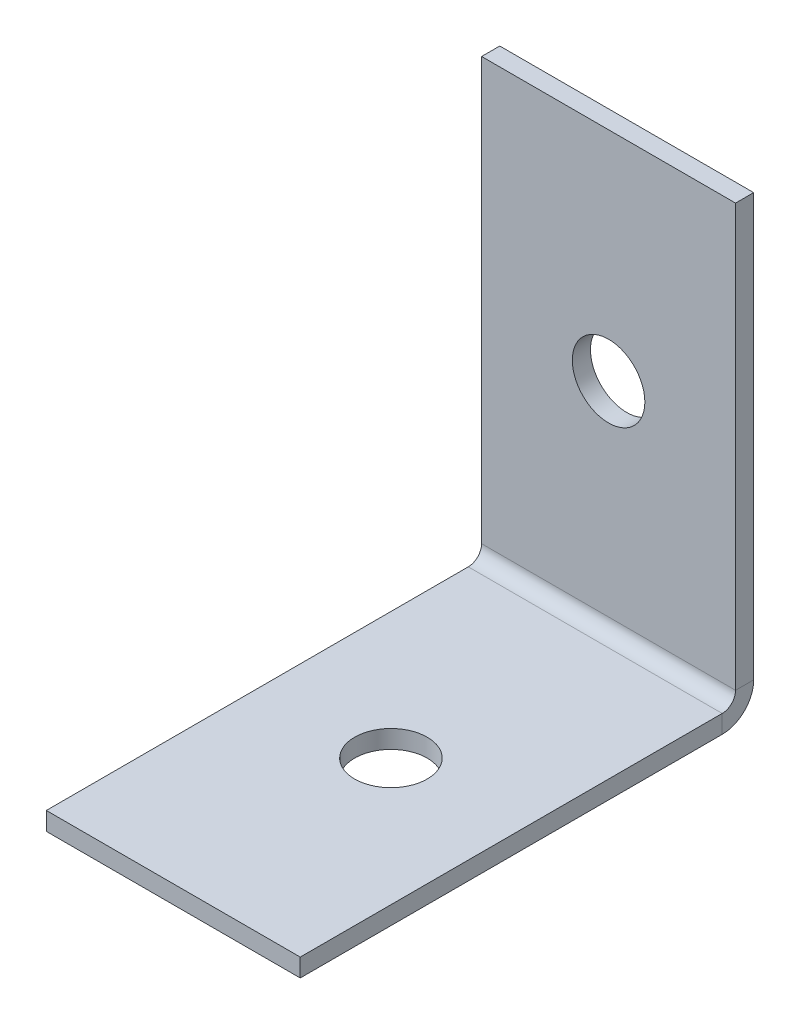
ISO-10303-21;
HEADER;
FILE_DESCRIPTION(('STEP AP214'),'2;1');
FILE_NAME('part.step','',(''),(''),'','','');
FILE_SCHEMA(('AUTOMOTIVE_DESIGN { 1 0 10303 214 1 1 1 1 }'));
ENDSEC;
DATA;
#1=APPLICATION_CONTEXT('core data for automotive mechanical design processes');
#2=APPLICATION_PROTOCOL_DEFINITION('international standard','automotive_design',2000,#1);
#3=PRODUCT_CONTEXT('',#1,'mechanical');
#4=PRODUCT('Part','Part','',(#3));
#5=PRODUCT_RELATED_PRODUCT_CATEGORY('part','',(#4));
#6=PRODUCT_DEFINITION_FORMATION('','',#4);
#7=PRODUCT_DEFINITION_CONTEXT('part definition',#1,'design');
#8=PRODUCT_DEFINITION('design','',#6,#7);
#9=PRODUCT_DEFINITION_SHAPE('','',#8);
#10=(LENGTH_UNIT() NAMED_UNIT(*) SI_UNIT(.MILLI.,.METRE.));
#11=(NAMED_UNIT(*) PLANE_ANGLE_UNIT() SI_UNIT($,.RADIAN.));
#12=(NAMED_UNIT(*) SI_UNIT($,.STERADIAN.) SOLID_ANGLE_UNIT());
#13=UNCERTAINTY_MEASURE_WITH_UNIT(LENGTH_MEASURE(1.E-05),#10,'distance_accuracy_value','');
#14=(GEOMETRIC_REPRESENTATION_CONTEXT(3) GLOBAL_UNCERTAINTY_ASSIGNED_CONTEXT((#13)) GLOBAL_UNIT_ASSIGNED_CONTEXT((#10,
#11,#12)) REPRESENTATION_CONTEXT('',''));
#15=CARTESIAN_POINT('',(0.,0.,0.));
#16=DIRECTION('',(0.,0.,1.));
#17=DIRECTION('',(1.,0.,0.));
#18=AXIS2_PLACEMENT_3D('',#15,#16,#17);
#19=CARTESIAN_POINT('',(7.,0.,1.7366));
#20=DIRECTION('',(1.,0.,0.));
#21=DIRECTION('',(0.,0.,-1.));
#22=AXIS2_PLACEMENT_3D('',#19,#20,#21);
#23=PLANE('',#22);
#24=DIRECTION('',(0.,1.,0.));
#25=VECTOR('',#24,1.);
#26=CARTESIAN_POINT('',(7.,0.,1.7366));
#27=LINE('',#26,#25);
#28=CARTESIAN_POINT('',(7.,0.,1.7366));
#29=VERTEX_POINT('',#28);
#30=CARTESIAN_POINT('',(7.,1.,1.7366));
#31=VERTEX_POINT('',#30);
#32=EDGE_CURVE('E11',#29,#31,#27,.T.);
#33=ORIENTED_EDGE('',*,*,#32,.F.);
#34=CARTESIAN_POINT('',(7.,1.7366,1.7366));
#35=DIRECTION('',(1.,0.,0.));
#36=DIRECTION('',(0.,0.,-1.));
#37=AXIS2_PLACEMENT_3D('',#34,#35,#36);
#38=CIRCLE('',#37,1.7366);
#39=CARTESIAN_POINT('',(7.,1.7366,0.));
#40=VERTEX_POINT('',#39);
#41=EDGE_CURVE('E131',#40,#29,#38,.F.);
#42=ORIENTED_EDGE('',*,*,#41,.F.);
#43=DIRECTION('',(0.,0.,-1.));
#44=VECTOR('',#43,1.);
#45=CARTESIAN_POINT('',(7.,1.7366,1.));
#46=LINE('',#45,#44);
#47=CARTESIAN_POINT('',(7.,1.7366,1.));
#48=VERTEX_POINT('',#47);
#49=EDGE_CURVE('E42',#48,#40,#46,.T.);
#50=ORIENTED_EDGE('',*,*,#49,.F.);
#51=CARTESIAN_POINT('',(7.,1.7366,1.7366));
#52=DIRECTION('',(1.,0.,0.));
#53=DIRECTION('',(0.,0.,-1.));
#54=AXIS2_PLACEMENT_3D('',#51,#52,#53);
#55=CIRCLE('',#54,0.7366);
#56=EDGE_CURVE('E124',#48,#31,#55,.F.);
#57=ORIENTED_EDGE('',*,*,#56,.T.);
#58=EDGE_LOOP('',(#33,#42,#50,#57));
#59=FACE_BOUND('',#58,.T.);
#60=ADVANCED_FACE('F34',(#59),#23,.T.);
#61=CARTESIAN_POINT('',(7.,1.7366,1.));
#62=DIRECTION('',(1.,0.,0.));
#63=DIRECTION('',(0.,0.,-1.));
#64=AXIS2_PLACEMENT_3D('',#61,#62,#63);
#65=PLANE('',#64);
#66=DIRECTION('',(0.,0.,1.));
#67=VECTOR('',#66,1.);
#68=CARTESIAN_POINT('',(7.,0.,0.));
#69=LINE('',#68,#67);
#70=CARTESIAN_POINT('',(7.,0.,25.));
#71=VERTEX_POINT('',#70);
#72=EDGE_CURVE('E181',#29,#71,#69,.T.);
#73=ORIENTED_EDGE('',*,*,#72,.F.);
#74=ORIENTED_EDGE('',*,*,#32,.T.);
#75=DIRECTION('',(0.,0.,1.));
#76=VECTOR('',#75,1.);
#77=CARTESIAN_POINT('',(7.,1.,0.));
#78=LINE('',#77,#76);
#79=CARTESIAN_POINT('',(7.,0.999999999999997,25.));
#80=VERTEX_POINT('',#79);
#81=EDGE_CURVE('E90',#31,#80,#78,.T.);
#82=ORIENTED_EDGE('',*,*,#81,.T.);
#83=DIRECTION('',(0.,1.,0.));
#84=VECTOR('',#83,1.);
#85=CARTESIAN_POINT('',(7.,0.,25.));
#86=LINE('',#85,#84);
#87=EDGE_CURVE('E377',#71,#80,#86,.T.);
#88=ORIENTED_EDGE('',*,*,#87,.F.);
#89=EDGE_LOOP('',(#73,#74,#82,#88));
#90=FACE_BOUND('',#89,.T.);
#91=ADVANCED_FACE('F189',(#90),#65,.T.);
#92=CARTESIAN_POINT('',(-7.,1.7366,0.));
#93=DIRECTION('',(-1.,0.,0.));
#94=DIRECTION('',(0.,0.,1.));
#95=AXIS2_PLACEMENT_3D('',#92,#93,#94);
#96=PLANE('',#95);
#97=DIRECTION('',(0.,0.,1.));
#98=VECTOR('',#97,1.);
#99=CARTESIAN_POINT('',(-7.,1.7366,0.));
#100=LINE('',#99,#98);
#101=CARTESIAN_POINT('',(-7.,1.7366,0.));
#102=VERTEX_POINT('',#101);
#103=CARTESIAN_POINT('',(-7.,1.7366,1.));
#104=VERTEX_POINT('',#103);
#105=EDGE_CURVE('E77',#102,#104,#100,.T.);
#106=ORIENTED_EDGE('',*,*,#105,.F.);
#107=CARTESIAN_POINT('',(-7.,1.7366,1.7366));
#108=DIRECTION('',(1.,0.,0.));
#109=DIRECTION('',(0.,0.,-1.));
#110=AXIS2_PLACEMENT_3D('',#107,#108,#109);
#111=CIRCLE('',#110,1.7366);
#112=CARTESIAN_POINT('',(-7.,0.,1.7366));
#113=VERTEX_POINT('',#112);
#114=EDGE_CURVE('E147',#102,#113,#111,.F.);
#115=ORIENTED_EDGE('',*,*,#114,.T.);
#116=DIRECTION('',(0.,-1.,0.));
#117=VECTOR('',#116,1.);
#118=CARTESIAN_POINT('',(-7.,1.,1.7366));
#119=LINE('',#118,#117);
#120=CARTESIAN_POINT('',(-7.,1.,1.7366));
#121=VERTEX_POINT('',#120);
#122=EDGE_CURVE('E84',#121,#113,#119,.T.);
#123=ORIENTED_EDGE('',*,*,#122,.F.);
#124=CARTESIAN_POINT('',(-7.,1.7366,1.7366));
#125=DIRECTION('',(1.,0.,0.));
#126=DIRECTION('',(0.,0.,-1.));
#127=AXIS2_PLACEMENT_3D('',#124,#125,#126);
#128=CIRCLE('',#127,0.7366);
#129=EDGE_CURVE('E154',#104,#121,#128,.F.);
#130=ORIENTED_EDGE('',*,*,#129,.F.);
#131=EDGE_LOOP('',(#106,#115,#123,#130));
#132=FACE_BOUND('',#131,.T.);
#133=ADVANCED_FACE('F187',(#132),#96,.T.);
#134=CARTESIAN_POINT('',(-7.,1.,1.7366));
#135=DIRECTION('',(-1.,0.,0.));
#136=DIRECTION('',(0.,0.,1.));
#137=AXIS2_PLACEMENT_3D('',#134,#135,#136);
#138=PLANE('',#137);
#139=DIRECTION('',(0.,-1.,0.));
#140=VECTOR('',#139,1.);
#141=CARTESIAN_POINT('',(-7.,25.,0.));
#142=LINE('',#141,#140);
#143=CARTESIAN_POINT('',(-7.,25.,0.));
#144=VERTEX_POINT('',#143);
#145=EDGE_CURVE('E149',#144,#102,#142,.T.);
#146=ORIENTED_EDGE('',*,*,#145,.T.);
#147=ORIENTED_EDGE('',*,*,#105,.T.);
#148=DIRECTION('',(0.,-1.,0.));
#149=VECTOR('',#148,1.);
#150=CARTESIAN_POINT('',(-7.,25.,0.999999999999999));
#151=LINE('',#150,#149);
#152=CARTESIAN_POINT('',(-7.,25.,0.999999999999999));
#153=VERTEX_POINT('',#152);
#154=EDGE_CURVE('E152',#153,#104,#151,.T.);
#155=ORIENTED_EDGE('',*,*,#154,.F.);
#156=DIRECTION('',(0.,0.,-1.));
#157=VECTOR('',#156,1.);
#158=CARTESIAN_POINT('',(-7.,25.,0.999999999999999));
#159=LINE('',#158,#157);
#160=EDGE_CURVE('E112',#153,#144,#159,.T.);
#161=ORIENTED_EDGE('',*,*,#160,.T.);
#162=EDGE_LOOP('',(#146,#147,#155,#161));
#163=FACE_BOUND('',#162,.T.);
#164=ADVANCED_FACE('F183',(#163),#138,.T.);
#165=CARTESIAN_POINT('',(7.,1.,0.));
#166=DIRECTION('',(0.,-1.,0.));
#167=DIRECTION('',(0.,0.,-1.));
#168=AXIS2_PLACEMENT_3D('',#165,#166,#167);
#169=PLANE('',#168);
#170=CARTESIAN_POINT('',(0.,0.999999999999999,13.));
#171=DIRECTION('',(0.,1.,0.));
#172=DIRECTION('',(0.,0.,1.));
#173=AXIS2_PLACEMENT_3D('',#170,#171,#172);
#174=CIRCLE('',#173,2.);
#175=CARTESIAN_POINT('',(0.,0.999999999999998,15.));
#176=VERTEX_POINT('',#175);
#177=EDGE_CURVE('E367',#176,#176,#174,.T.);
#178=ORIENTED_EDGE('',*,*,#177,.F.);
#179=EDGE_LOOP('',(#178));
#180=FACE_BOUND('',#179,.T.);
#181=DIRECTION('',(0.,0.,1.));
#182=VECTOR('',#181,1.);
#183=CARTESIAN_POINT('',(-7.,1.,0.));
#184=LINE('',#183,#182);
#185=CARTESIAN_POINT('',(-7.,0.999999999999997,25.));
#186=VERTEX_POINT('',#185);
#187=EDGE_CURVE('E137',#121,#186,#184,.T.);
#188=ORIENTED_EDGE('',*,*,#187,.T.);
#189=DIRECTION('',(-1.,0.,0.));
#190=VECTOR('',#189,1.);
#191=CARTESIAN_POINT('',(7.,0.999999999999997,25.));
#192=LINE('',#191,#190);
#193=EDGE_CURVE('E168',#80,#186,#192,.T.);
#194=ORIENTED_EDGE('',*,*,#193,.F.);
#195=ORIENTED_EDGE('',*,*,#81,.F.);
#196=DIRECTION('',(-1.,0.,0.));
#197=VECTOR('',#196,1.);
#198=CARTESIAN_POINT('',(7.,1.,1.7366));
#199=LINE('',#198,#197);
#200=EDGE_CURVE('E136',#31,#121,#199,.T.);
#201=ORIENTED_EDGE('',*,*,#200,.T.);
#202=EDGE_LOOP('',(#188,#194,#195,#201));
#203=FACE_BOUND('',#202,.T.);
#204=ADVANCED_FACE('F195',(#180,#203),#169,.F.);
#205=CARTESIAN_POINT('',(7.,0.,25.));
#206=DIRECTION('',(0.,0.,1.));
#207=DIRECTION('',(1.,0.,0.));
#208=AXIS2_PLACEMENT_3D('',#205,#206,#207);
#209=PLANE('',#208);
#210=DIRECTION('',(0.,1.,0.));
#211=VECTOR('',#210,1.);
#212=CARTESIAN_POINT('',(-7.,0.,25.));
#213=LINE('',#212,#211);
#214=CARTESIAN_POINT('',(-7.,0.,25.));
#215=VERTEX_POINT('',#214);
#216=EDGE_CURVE('E140',#215,#186,#213,.T.);
#217=ORIENTED_EDGE('',*,*,#216,.F.);
#218=DIRECTION('',(-1.,0.,0.));
#219=VECTOR('',#218,1.);
#220=CARTESIAN_POINT('',(7.,0.,25.));
#221=LINE('',#220,#219);
#222=EDGE_CURVE('E166',#71,#215,#221,.T.);
#223=ORIENTED_EDGE('',*,*,#222,.F.);
#224=ORIENTED_EDGE('',*,*,#87,.T.);
#225=ORIENTED_EDGE('',*,*,#193,.T.);
#226=EDGE_LOOP('',(#217,#223,#224,#225));
#227=FACE_BOUND('',#226,.T.);
#228=ADVANCED_FACE('F224',(#227),#209,.T.);
#229=CARTESIAN_POINT('',(7.,0.,0.));
#230=DIRECTION('',(0.,-1.,0.));
#231=DIRECTION('',(0.,0.,-1.));
#232=AXIS2_PLACEMENT_3D('',#229,#230,#231);
#233=PLANE('',#232);
#234=CARTESIAN_POINT('',(0.,0.,13.));
#235=DIRECTION('',(0.,-1.,0.));
#236=DIRECTION('',(0.,0.,-1.));
#237=AXIS2_PLACEMENT_3D('',#234,#235,#236);
#238=CIRCLE('',#237,2.);
#239=CARTESIAN_POINT('',(0.,0.,15.));
#240=VERTEX_POINT('',#239);
#241=EDGE_CURVE('E364',#240,#240,#238,.F.);
#242=ORIENTED_EDGE('',*,*,#241,.T.);
#243=EDGE_LOOP('',(#242));
#244=FACE_BOUND('',#243,.T.);
#245=DIRECTION('',(0.,0.,1.));
#246=VECTOR('',#245,1.);
#247=CARTESIAN_POINT('',(-7.,0.,0.));
#248=LINE('',#247,#246);
#249=EDGE_CURVE('E144',#113,#215,#248,.T.);
#250=ORIENTED_EDGE('',*,*,#249,.F.);
#251=DIRECTION('',(-1.,0.,0.));
#252=VECTOR('',#251,1.);
#253=CARTESIAN_POINT('',(7.,0.,1.7366));
#254=LINE('',#253,#252);
#255=EDGE_CURVE('E163',#29,#113,#254,.T.);
#256=ORIENTED_EDGE('',*,*,#255,.F.);
#257=ORIENTED_EDGE('',*,*,#72,.T.);
#258=ORIENTED_EDGE('',*,*,#222,.T.);
#259=EDGE_LOOP('',(#250,#256,#257,#258));
#260=FACE_BOUND('',#259,.T.);
#261=ADVANCED_FACE('F229',(#244,#260),#233,.T.);
#262=CARTESIAN_POINT('',(7.,1.7366,1.7366));
#263=DIRECTION('',(-1.,0.,0.));
#264=DIRECTION('',(0.,0.,1.));
#265=AXIS2_PLACEMENT_3D('',#262,#263,#264);
#266=CYLINDRICAL_SURFACE('',#265,1.7366);
#267=ORIENTED_EDGE('',*,*,#114,.F.);
#268=DIRECTION('',(-1.,0.,0.));
#269=VECTOR('',#268,1.);
#270=CARTESIAN_POINT('',(7.,1.7366,0.));
#271=LINE('',#270,#269);
#272=EDGE_CURVE('E160',#40,#102,#271,.T.);
#273=ORIENTED_EDGE('',*,*,#272,.F.);
#274=ORIENTED_EDGE('',*,*,#41,.T.);
#275=ORIENTED_EDGE('',*,*,#255,.T.);
#276=EDGE_LOOP('',(#267,#273,#274,#275));
#277=FACE_BOUND('',#276,.T.);
#278=ADVANCED_FACE('F177',(#277),#266,.T.);
#279=CARTESIAN_POINT('',(7.,25.,0.));
#280=DIRECTION('',(0.,0.,-1.));
#281=DIRECTION('',(0.,1.,0.));
#282=AXIS2_PLACEMENT_3D('',#279,#280,#281);
#283=PLANE('',#282);
#284=CARTESIAN_POINT('',(0.,13.,0.));
#285=DIRECTION('',(0.,0.,-1.));
#286=DIRECTION('',(0.,1.,0.));
#287=AXIS2_PLACEMENT_3D('',#284,#285,#286);
#288=CIRCLE('',#287,2.);
#289=CARTESIAN_POINT('',(0.,15.,0.));
#290=VERTEX_POINT('',#289);
#291=EDGE_CURVE('E368',#290,#290,#288,.F.);
#292=ORIENTED_EDGE('',*,*,#291,.T.);
#293=EDGE_LOOP('',(#292));
#294=FACE_BOUND('',#293,.T.);
#295=ORIENTED_EDGE('',*,*,#145,.F.);
#296=DIRECTION('',(-1.,0.,0.));
#297=VECTOR('',#296,1.);
#298=CARTESIAN_POINT('',(7.,25.,0.));
#299=LINE('',#298,#297);
#300=CARTESIAN_POINT('',(7.,25.,0.));
#301=VERTEX_POINT('',#300);
#302=EDGE_CURVE('E114',#301,#144,#299,.T.);
#303=ORIENTED_EDGE('',*,*,#302,.F.);
#304=DIRECTION('',(0.,-1.,0.));
#305=VECTOR('',#304,1.);
#306=CARTESIAN_POINT('',(7.,25.,0.));
#307=LINE('',#306,#305);
#308=EDGE_CURVE('E129',#301,#40,#307,.T.);
#309=ORIENTED_EDGE('',*,*,#308,.T.);
#310=ORIENTED_EDGE('',*,*,#272,.T.);
#311=EDGE_LOOP('',(#295,#303,#309,#310));
#312=FACE_BOUND('',#311,.T.);
#313=ADVANCED_FACE('F182',(#294,#312),#283,.T.);
#314=CARTESIAN_POINT('',(7.,25.,0.999999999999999));
#315=DIRECTION('',(0.,1.,0.));
#316=DIRECTION('',(0.,0.,1.));
#317=AXIS2_PLACEMENT_3D('',#314,#315,#316);
#318=PLANE('',#317);
#319=ORIENTED_EDGE('',*,*,#160,.F.);
#320=DIRECTION('',(-1.,0.,0.));
#321=VECTOR('',#320,1.);
#322=CARTESIAN_POINT('',(7.,25.,0.999999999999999));
#323=LINE('',#322,#321);
#324=CARTESIAN_POINT('',(7.,25.,0.999999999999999));
#325=VERTEX_POINT('',#324);
#326=EDGE_CURVE('E106',#325,#153,#323,.T.);
#327=ORIENTED_EDGE('',*,*,#326,.F.);
#328=DIRECTION('',(0.,0.,-1.));
#329=VECTOR('',#328,1.);
#330=CARTESIAN_POINT('',(7.,25.,0.999999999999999));
#331=LINE('',#330,#329);
#332=EDGE_CURVE('E110',#325,#301,#331,.T.);
#333=ORIENTED_EDGE('',*,*,#332,.T.);
#334=ORIENTED_EDGE('',*,*,#302,.T.);
#335=EDGE_LOOP('',(#319,#327,#333,#334));
#336=FACE_BOUND('',#335,.T.);
#337=ADVANCED_FACE('F108',(#336),#318,.T.);
#338=CARTESIAN_POINT('',(7.,25.,0.999999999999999));
#339=DIRECTION('',(0.,0.,-1.));
#340=DIRECTION('',(0.,1.,0.));
#341=AXIS2_PLACEMENT_3D('',#338,#339,#340);
#342=PLANE('',#341);
#343=CARTESIAN_POINT('',(0.,13.,1.));
#344=DIRECTION('',(0.,0.,1.));
#345=DIRECTION('',(1.,0.,0.));
#346=AXIS2_PLACEMENT_3D('',#343,#344,#345);
#347=CIRCLE('',#346,2.);
#348=CARTESIAN_POINT('',(2.,13.,1.));
#349=VERTEX_POINT('',#348);
#350=EDGE_CURVE('E141',#349,#349,#347,.T.);
#351=ORIENTED_EDGE('',*,*,#350,.F.);
#352=EDGE_LOOP('',(#351));
#353=FACE_BOUND('',#352,.T.);
#354=ORIENTED_EDGE('',*,*,#154,.T.);
#355=DIRECTION('',(-1.,0.,0.));
#356=VECTOR('',#355,1.);
#357=CARTESIAN_POINT('',(7.,1.7366,1.));
#358=LINE('',#357,#356);
#359=EDGE_CURVE('E115',#48,#104,#358,.T.);
#360=ORIENTED_EDGE('',*,*,#359,.F.);
#361=DIRECTION('',(0.,-1.,0.));
#362=VECTOR('',#361,1.);
#363=CARTESIAN_POINT('',(7.,25.,0.999999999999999));
#364=LINE('',#363,#362);
#365=EDGE_CURVE('E119',#325,#48,#364,.T.);
#366=ORIENTED_EDGE('',*,*,#365,.F.);
#367=ORIENTED_EDGE('',*,*,#326,.T.);
#368=EDGE_LOOP('',(#354,#360,#366,#367));
#369=FACE_BOUND('',#368,.T.);
#370=ADVANCED_FACE('F120',(#353,#369),#342,.F.);
#371=CARTESIAN_POINT('',(7.,1.7366,1.7366));
#372=DIRECTION('',(-1.,0.,0.));
#373=DIRECTION('',(0.,0.,1.));
#374=AXIS2_PLACEMENT_3D('',#371,#372,#373);
#375=CYLINDRICAL_SURFACE('',#374,0.7366);
#376=ORIENTED_EDGE('',*,*,#129,.T.);
#377=ORIENTED_EDGE('',*,*,#200,.F.);
#378=ORIENTED_EDGE('',*,*,#56,.F.);
#379=ORIENTED_EDGE('',*,*,#359,.T.);
#380=EDGE_LOOP('',(#376,#377,#378,#379));
#381=FACE_BOUND('',#380,.T.);
#382=ADVANCED_FACE('F185',(#381),#375,.F.);
#383=CARTESIAN_POINT('',(7.,1.7366,1.7366));
#384=DIRECTION('',(1.,0.,0.));
#385=DIRECTION('',(0.,0.,-1.));
#386=AXIS2_PLACEMENT_3D('',#383,#384,#385);
#387=PLANE('',#386);
#388=ORIENTED_EDGE('',*,*,#365,.T.);
#389=ORIENTED_EDGE('',*,*,#49,.T.);
#390=ORIENTED_EDGE('',*,*,#308,.F.);
#391=ORIENTED_EDGE('',*,*,#332,.F.);
#392=EDGE_LOOP('',(#388,#389,#390,#391));
#393=FACE_BOUND('',#392,.T.);
#394=ADVANCED_FACE('F127',(#393),#387,.T.);
#395=CARTESIAN_POINT('',(-7.,1.7366,1.7366));
#396=DIRECTION('',(1.,0.,0.));
#397=DIRECTION('',(0.,0.,-1.));
#398=AXIS2_PLACEMENT_3D('',#395,#396,#397);
#399=PLANE('',#398);
#400=ORIENTED_EDGE('',*,*,#187,.F.);
#401=ORIENTED_EDGE('',*,*,#122,.T.);
#402=ORIENTED_EDGE('',*,*,#249,.T.);
#403=ORIENTED_EDGE('',*,*,#216,.T.);
#404=EDGE_LOOP('',(#400,#401,#402,#403));
#405=FACE_BOUND('',#404,.T.);
#406=ADVANCED_FACE('F273',(#405),#399,.F.);
#407=CARTESIAN_POINT('',(0.,13.,-0.00100000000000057));
#408=DIRECTION('',(0.,0.,1.));
#409=DIRECTION('',(1.,0.,0.));
#410=AXIS2_PLACEMENT_3D('',#407,#408,#409);
#411=CYLINDRICAL_SURFACE('',#410,2.);
#412=ORIENTED_EDGE('',*,*,#291,.F.);
#413=EDGE_LOOP('',(#412));
#414=FACE_BOUND('',#413,.T.);
#415=ORIENTED_EDGE('',*,*,#350,.T.);
#416=EDGE_LOOP('',(#415));
#417=FACE_BOUND('',#416,.T.);
#418=ADVANCED_FACE('F283',(#414,#417),#411,.F.);
#419=CARTESIAN_POINT('',(0.,-0.00100000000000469,13.));
#420=DIRECTION('',(0.,1.,0.));
#421=DIRECTION('',(0.,0.,1.));
#422=AXIS2_PLACEMENT_3D('',#419,#420,#421);
#423=CYLINDRICAL_SURFACE('',#422,2.);
#424=CARTESIAN_POINT('',(0.,0.,15.));
#425=CARTESIAN_POINT('',(0.,0.0104166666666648,15.));
#426=CARTESIAN_POINT('',(0.,0.0208333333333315,15.));
#427=CARTESIAN_POINT('',(0.,0.0416666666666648,15.));
#428=CARTESIAN_POINT('',(0.,0.0520833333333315,15.));
#429=CARTESIAN_POINT('',(0.,0.0729166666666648,15.));
#430=CARTESIAN_POINT('',(0.,0.0833333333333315,15.));
#431=CARTESIAN_POINT('',(0.,0.104166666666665,15.));
#432=CARTESIAN_POINT('',(0.,0.114583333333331,15.));
#433=CARTESIAN_POINT('',(0.,0.135416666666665,15.));
#434=CARTESIAN_POINT('',(0.,0.145833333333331,15.));
#435=CARTESIAN_POINT('',(0.,0.166666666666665,15.));
#436=CARTESIAN_POINT('',(0.,0.177083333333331,15.));
#437=CARTESIAN_POINT('',(0.,0.197916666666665,15.));
#438=CARTESIAN_POINT('',(0.,0.208333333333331,15.));
#439=CARTESIAN_POINT('',(0.,0.229166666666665,15.));
#440=CARTESIAN_POINT('',(0.,0.239583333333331,15.));
#441=CARTESIAN_POINT('',(0.,0.260416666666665,15.));
#442=CARTESIAN_POINT('',(0.,0.270833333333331,15.));
#443=CARTESIAN_POINT('',(0.,0.291666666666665,15.));
#444=CARTESIAN_POINT('',(0.,0.302083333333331,15.));
#445=CARTESIAN_POINT('',(0.,0.322916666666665,15.));
#446=CARTESIAN_POINT('',(0.,0.333333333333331,15.));
#447=CARTESIAN_POINT('',(0.,0.354166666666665,15.));
#448=CARTESIAN_POINT('',(0.,0.364583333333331,15.));
#449=CARTESIAN_POINT('',(0.,0.385416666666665,15.));
#450=CARTESIAN_POINT('',(0.,0.395833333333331,15.));
#451=CARTESIAN_POINT('',(0.,0.416666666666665,15.));
#452=CARTESIAN_POINT('',(0.,0.427083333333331,15.));
#453=CARTESIAN_POINT('',(0.,0.447916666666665,15.));
#454=CARTESIAN_POINT('',(0.,0.458333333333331,15.));
#455=CARTESIAN_POINT('',(0.,0.479166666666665,15.));
#456=CARTESIAN_POINT('',(0.,0.489583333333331,15.));
#457=CARTESIAN_POINT('',(0.,0.510416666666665,15.));
#458=CARTESIAN_POINT('',(0.,0.520833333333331,15.));
#459=CARTESIAN_POINT('',(0.,0.541666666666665,15.));
#460=CARTESIAN_POINT('',(0.,0.552083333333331,15.));
#461=CARTESIAN_POINT('',(0.,0.572916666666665,15.));
#462=CARTESIAN_POINT('',(0.,0.583333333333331,15.));
#463=CARTESIAN_POINT('',(0.,0.604166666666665,15.));
#464=CARTESIAN_POINT('',(0.,0.614583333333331,15.));
#465=CARTESIAN_POINT('',(0.,0.635416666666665,15.));
#466=CARTESIAN_POINT('',(0.,0.645833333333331,15.));
#467=CARTESIAN_POINT('',(0.,0.666666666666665,15.));
#468=CARTESIAN_POINT('',(0.,0.677083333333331,15.));
#469=CARTESIAN_POINT('',(0.,0.697916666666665,15.));
#470=CARTESIAN_POINT('',(0.,0.708333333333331,15.));
#471=CARTESIAN_POINT('',(0.,0.729166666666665,15.));
#472=CARTESIAN_POINT('',(0.,0.739583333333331,15.));
#473=CARTESIAN_POINT('',(0.,0.760416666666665,15.));
#474=CARTESIAN_POINT('',(0.,0.770833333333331,15.));
#475=CARTESIAN_POINT('',(0.,0.791666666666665,15.));
#476=CARTESIAN_POINT('',(0.,0.802083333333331,15.));
#477=CARTESIAN_POINT('',(0.,0.822916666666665,15.));
#478=CARTESIAN_POINT('',(0.,0.833333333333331,15.));
#479=CARTESIAN_POINT('',(0.,0.854166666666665,15.));
#480=CARTESIAN_POINT('',(0.,0.864583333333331,15.));
#481=CARTESIAN_POINT('',(0.,0.885416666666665,15.));
#482=CARTESIAN_POINT('',(0.,0.895833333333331,15.));
#483=CARTESIAN_POINT('',(0.,0.916666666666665,15.));
#484=CARTESIAN_POINT('',(0.,0.927083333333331,15.));
#485=CARTESIAN_POINT('',(0.,0.947916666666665,15.));
#486=CARTESIAN_POINT('',(0.,0.958333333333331,15.));
#487=CARTESIAN_POINT('',(0.,0.979166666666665,15.));
#488=CARTESIAN_POINT('',(0.,0.989583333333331,15.));
#489=CARTESIAN_POINT('',(0.,0.999999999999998,15.));
#490=B_SPLINE_CURVE_WITH_KNOTS('',3,(#424,#425,#426,#427,#428,#429,#430,#431,#432,#433,#434,
#435,#436,#437,#438,#439,#440,#441,#442,#443,#444,#445,#446,#447,#448,#449,#450,#451,#452,#453,
#454,#455,#456,#457,#458,#459,#460,#461,#462,#463,#464,#465,#466,#467,#468,#469,#470,#471,#472,
#473,#474,#475,#476,#477,#478,#479,#480,#481,#482,#483,#484,#485,#486,#487,#488,#489),
.UNSPECIFIED.,.F.,.F.,(4,2,2,2,2,2,2,2,2,2,2,2,2,2,2,2,2,2,2,2,2,2,2,2,2,2,2,2,2,2,2,2,4),(0.,
0.03125,0.0625,0.09375,0.125,0.15625,0.1875,0.21875,0.25,0.28125,0.3125,0.34375,0.375,0.40625,
0.4375,0.46875,0.5,0.53125,0.5625,0.59375,0.625,0.65625,0.6875,0.71875,0.75,0.78125,0.8125,
0.84375,0.875,0.90625,0.9375,0.96875,1.),.UNSPECIFIED.);
#491=EDGE_CURVE('BSEAM310',#240,#176,#490,.T.);
#492=ORIENTED_EDGE('',*,*,#241,.F.);
#493=ORIENTED_EDGE('',*,*,#177,.T.);
#494=ORIENTED_EDGE('',*,*,#491,.T.);
#495=ORIENTED_EDGE('',*,*,#491,.F.);
#496=EDGE_LOOP('',(#492,#494,#493,#495));
#497=FACE_BOUND('',#496,.T.);
#498=ADVANCED_FACE('F310',(#497),#423,.F.);
#499=CLOSED_SHELL('',(#60,#91,#133,#164,#204,#228,#261,#278,#313,#337,#370,#382,#394,#406,#418,#498));
#500=MANIFOLD_SOLID_BREP('B2',#499);
#501=ADVANCED_BREP_SHAPE_REPRESENTATION('',(#18,#500),#14);
#502=SHAPE_DEFINITION_REPRESENTATION(#9,#501);
ENDSEC;
END-ISO-10303-21;
